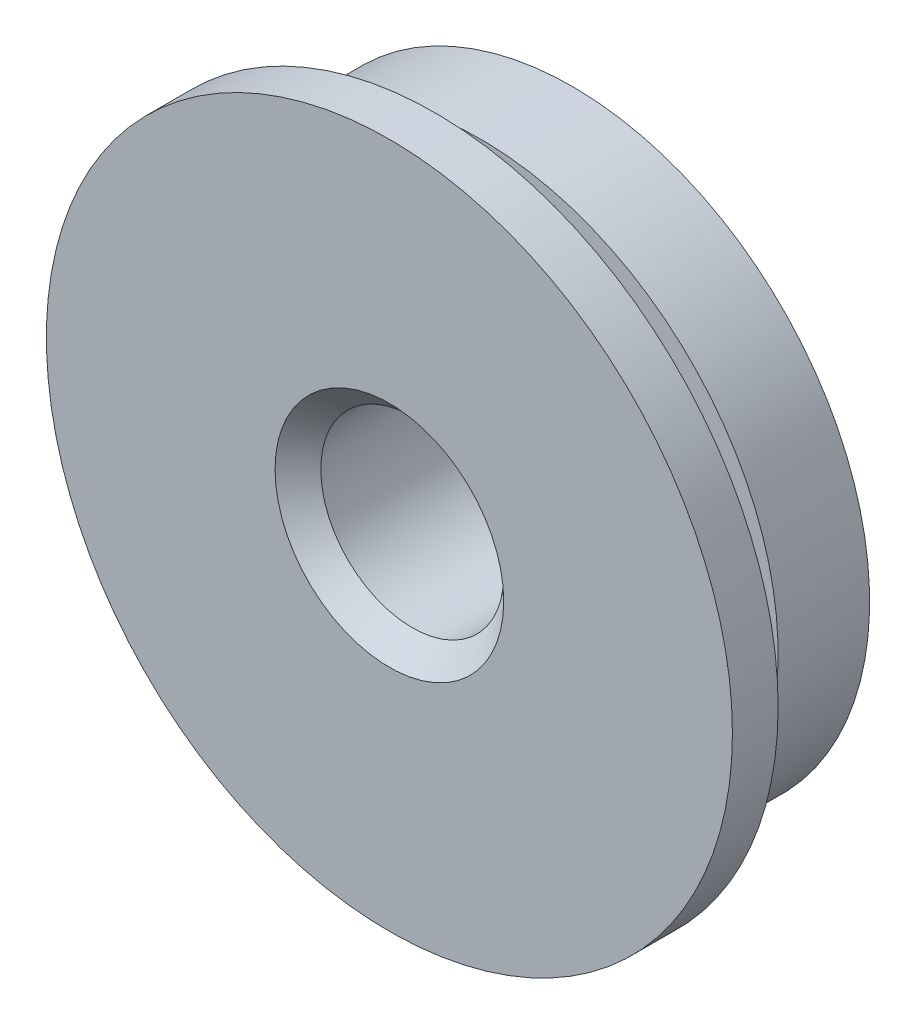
ISO-10303-21;
HEADER;
FILE_DESCRIPTION(('STEP AP214'),'2;1');
FILE_NAME('part.step','',(''),(''),'','','');
FILE_SCHEMA(('AUTOMOTIVE_DESIGN { 1 0 10303 214 1 1 1 1 }'));
ENDSEC;
DATA;
#1=APPLICATION_CONTEXT('core data for automotive mechanical design processes');
#2=APPLICATION_PROTOCOL_DEFINITION('international standard','automotive_design',2000,#1);
#3=PRODUCT_CONTEXT('',#1,'mechanical');
#4=PRODUCT('Part','Part','',(#3));
#5=PRODUCT_RELATED_PRODUCT_CATEGORY('part','',(#4));
#6=PRODUCT_DEFINITION_FORMATION('','',#4);
#7=PRODUCT_DEFINITION_CONTEXT('part definition',#1,'design');
#8=PRODUCT_DEFINITION('design','',#6,#7);
#9=PRODUCT_DEFINITION_SHAPE('','',#8);
#10=(LENGTH_UNIT() NAMED_UNIT(*) SI_UNIT(.MILLI.,.METRE.));
#11=(NAMED_UNIT(*) PLANE_ANGLE_UNIT() SI_UNIT($,.RADIAN.));
#12=(NAMED_UNIT(*) SI_UNIT($,.STERADIAN.) SOLID_ANGLE_UNIT());
#13=UNCERTAINTY_MEASURE_WITH_UNIT(LENGTH_MEASURE(1.E-05),#10,'distance_accuracy_value','');
#14=(GEOMETRIC_REPRESENTATION_CONTEXT(3) GLOBAL_UNCERTAINTY_ASSIGNED_CONTEXT((#13)) GLOBAL_UNIT_ASSIGNED_CONTEXT((#10,
#11,#12)) REPRESENTATION_CONTEXT('',''));
#15=CARTESIAN_POINT('',(0.,0.,0.));
#16=DIRECTION('',(0.,0.,1.));
#17=DIRECTION('',(1.,0.,0.));
#18=AXIS2_PLACEMENT_3D('',#15,#16,#17);
#19=CARTESIAN_POINT('',(0.,0.,-2.));
#20=DIRECTION('',(0.,0.,1.));
#21=DIRECTION('',(1.,0.,0.));
#22=AXIS2_PLACEMENT_3D('',#19,#20,#21);
#23=PLANE('',#22);
#24=CARTESIAN_POINT('',(0.,0.,-2.));
#25=DIRECTION('',(0.,0.,1.));
#26=DIRECTION('',(1.,0.,0.));
#27=AXIS2_PLACEMENT_3D('',#24,#25,#26);
#28=CIRCLE('',#27,15.);
#29=CARTESIAN_POINT('',(15.,0.,-2.));
#30=VERTEX_POINT('',#29);
#31=EDGE_CURVE('E55',#30,#30,#28,.T.);
#32=ORIENTED_EDGE('',*,*,#31,.F.);
#33=EDGE_LOOP('',(#32));
#34=FACE_BOUND('',#33,.T.);
#35=CARTESIAN_POINT('',(0.,0.,-2.));
#36=DIRECTION('',(0.,0.,1.));
#37=DIRECTION('',(1.,0.,0.));
#38=AXIS2_PLACEMENT_3D('',#35,#36,#37);
#39=CIRCLE('',#38,12.);
#40=CARTESIAN_POINT('',(12.,0.,-2.));
#41=VERTEX_POINT('',#40);
#42=EDGE_CURVE('E52',#41,#41,#39,.F.);
#43=ORIENTED_EDGE('',*,*,#42,.F.);
#44=EDGE_LOOP('',(#43));
#45=FACE_BOUND('',#44,.T.);
#46=ADVANCED_FACE('F32',(#34,#45),#23,.F.);
#47=CARTESIAN_POINT('',(0.,0.,-2.));
#48=DIRECTION('',(0.,0.,1.));
#49=DIRECTION('',(1.,0.,0.));
#50=AXIS2_PLACEMENT_3D('',#47,#48,#49);
#51=CYLINDRICAL_SURFACE('',#50,15.);
#52=ORIENTED_EDGE('',*,*,#31,.T.);
#53=EDGE_LOOP('',(#52));
#54=FACE_BOUND('',#53,.T.);
#55=CARTESIAN_POINT('',(0.,0.,0.));
#56=DIRECTION('',(0.,0.,1.));
#57=DIRECTION('',(1.,0.,0.));
#58=AXIS2_PLACEMENT_3D('',#55,#56,#57);
#59=CIRCLE('',#58,15.);
#60=CARTESIAN_POINT('',(15.,0.,0.));
#61=VERTEX_POINT('',#60);
#62=EDGE_CURVE('E56',#61,#61,#59,.T.);
#63=ORIENTED_EDGE('',*,*,#62,.F.);
#64=EDGE_LOOP('',(#63));
#65=FACE_BOUND('',#64,.T.);
#66=ADVANCED_FACE('F93',(#54,#65),#51,.T.);
#67=CARTESIAN_POINT('',(0.,0.,0.));
#68=DIRECTION('',(0.,0.,1.));
#69=DIRECTION('',(1.,0.,0.));
#70=AXIS2_PLACEMENT_3D('',#67,#68,#69);
#71=PLANE('',#70);
#72=CARTESIAN_POINT('',(0.,0.,0.));
#73=DIRECTION('',(0.,0.,1.));
#74=DIRECTION('',(1.,0.,0.));
#75=AXIS2_PLACEMENT_3D('',#72,#73,#74);
#76=CIRCLE('',#75,5.);
#77=CARTESIAN_POINT('',(5.,0.,0.));
#78=VERTEX_POINT('',#77);
#79=EDGE_CURVE('E10',#78,#78,#76,.F.);
#80=ORIENTED_EDGE('',*,*,#79,.T.);
#81=EDGE_LOOP('',(#80));
#82=FACE_BOUND('',#81,.T.);
#83=ORIENTED_EDGE('',*,*,#62,.T.);
#84=EDGE_LOOP('',(#83));
#85=FACE_BOUND('',#84,.T.);
#86=ADVANCED_FACE('F88',(#82,#85),#71,.T.);
#87=CARTESIAN_POINT('',(0.,0.,-4.));
#88=DIRECTION('',(0.,0.,1.));
#89=DIRECTION('',(1.,0.,0.));
#90=AXIS2_PLACEMENT_3D('',#87,#88,#89);
#91=CYLINDRICAL_SURFACE('',#90,12.);
#92=CARTESIAN_POINT('',(0.,0.,-4.));
#93=DIRECTION('',(0.,0.,-1.));
#94=DIRECTION('',(-1.,0.,0.));
#95=AXIS2_PLACEMENT_3D('',#92,#93,#94);
#96=CIRCLE('',#95,12.);
#97=CARTESIAN_POINT('',(-12.,0.,-4.));
#98=VERTEX_POINT('',#97);
#99=EDGE_CURVE('E59',#98,#98,#96,.T.);
#100=ORIENTED_EDGE('',*,*,#99,.F.);
#101=EDGE_LOOP('',(#100));
#102=FACE_BOUND('',#101,.T.);
#103=ORIENTED_EDGE('',*,*,#42,.T.);
#104=EDGE_LOOP('',(#103));
#105=FACE_BOUND('',#104,.T.);
#106=ADVANCED_FACE('F82',(#102,#105),#91,.T.);
#107=CARTESIAN_POINT('',(0.,0.,-4.));
#108=DIRECTION('',(0.,0.,-1.));
#109=DIRECTION('',(-1.,0.,0.));
#110=AXIS2_PLACEMENT_3D('',#107,#108,#109);
#111=PLANE('',#110);
#112=CARTESIAN_POINT('',(0.,0.,-4.));
#113=DIRECTION('',(0.,0.,-1.));
#114=DIRECTION('',(-1.,0.,0.));
#115=AXIS2_PLACEMENT_3D('',#112,#113,#114);
#116=CIRCLE('',#115,13.);
#117=CARTESIAN_POINT('',(-13.,0.,-4.));
#118=VERTEX_POINT('',#117);
#119=EDGE_CURVE('E65',#118,#118,#116,.T.);
#120=ORIENTED_EDGE('',*,*,#119,.F.);
#121=EDGE_LOOP('',(#120));
#122=FACE_BOUND('',#121,.T.);
#123=ORIENTED_EDGE('',*,*,#99,.T.);
#124=EDGE_LOOP('',(#123));
#125=FACE_BOUND('',#124,.T.);
#126=ADVANCED_FACE('F76',(#122,#125),#111,.F.);
#127=CARTESIAN_POINT('',(0.,0.,-8.));
#128=DIRECTION('',(0.,0.,1.));
#129=DIRECTION('',(1.,0.,0.));
#130=AXIS2_PLACEMENT_3D('',#127,#128,#129);
#131=CYLINDRICAL_SURFACE('',#130,13.);
#132=CARTESIAN_POINT('',(0.,0.,-8.));
#133=DIRECTION('',(0.,0.,-1.));
#134=DIRECTION('',(-1.,0.,0.));
#135=AXIS2_PLACEMENT_3D('',#132,#133,#134);
#136=CIRCLE('',#135,13.);
#137=CARTESIAN_POINT('',(-13.,0.,-8.));
#138=VERTEX_POINT('',#137);
#139=EDGE_CURVE('E64',#138,#138,#136,.T.);
#140=ORIENTED_EDGE('',*,*,#139,.F.);
#141=EDGE_LOOP('',(#140));
#142=FACE_BOUND('',#141,.T.);
#143=ORIENTED_EDGE('',*,*,#119,.T.);
#144=EDGE_LOOP('',(#143));
#145=FACE_BOUND('',#144,.T.);
#146=ADVANCED_FACE('F73',(#142,#145),#131,.T.);
#147=CARTESIAN_POINT('',(0.,0.,-8.));
#148=DIRECTION('',(0.,0.,-1.));
#149=DIRECTION('',(-1.,0.,0.));
#150=AXIS2_PLACEMENT_3D('',#147,#148,#149);
#151=PLANE('',#150);
#152=CARTESIAN_POINT('',(0.,0.,-8.));
#153=DIRECTION('',(0.,0.,-1.));
#154=DIRECTION('',(-1.,0.,0.));
#155=AXIS2_PLACEMENT_3D('',#152,#153,#154);
#156=CIRCLE('',#155,5.00000000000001);
#157=CARTESIAN_POINT('',(-5.00000000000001,0.,-8.));
#158=VERTEX_POINT('',#157);
#159=EDGE_CURVE('E39',#158,#158,#156,.F.);
#160=ORIENTED_EDGE('',*,*,#159,.T.);
#161=EDGE_LOOP('',(#160));
#162=FACE_BOUND('',#161,.T.);
#163=ORIENTED_EDGE('',*,*,#139,.T.);
#164=EDGE_LOOP('',(#163));
#165=FACE_BOUND('',#164,.T.);
#166=ADVANCED_FACE('F71',(#162,#165),#151,.T.);
#167=CARTESIAN_POINT('',(0.,0.,-10.));
#168=DIRECTION('',(0.,0.,1.));
#169=DIRECTION('',(1.,0.,0.));
#170=AXIS2_PLACEMENT_3D('',#167,#168,#169);
#171=CYLINDRICAL_SURFACE('',#170,4.);
#172=CARTESIAN_POINT('',(0.,0.,-7.));
#173=DIRECTION('',(0.,0.,-1.));
#174=DIRECTION('',(-1.,0.,0.));
#175=AXIS2_PLACEMENT_3D('',#172,#173,#174);
#176=CIRCLE('',#175,4.);
#177=CARTESIAN_POINT('',(-4.,0.,-7.));
#178=VERTEX_POINT('',#177);
#179=EDGE_CURVE('E43',#178,#178,#176,.T.);
#180=ORIENTED_EDGE('',*,*,#179,.T.);
#181=EDGE_LOOP('',(#180));
#182=FACE_BOUND('',#181,.T.);
#183=CARTESIAN_POINT('',(0.,0.,-0.999999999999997));
#184=DIRECTION('',(0.,0.,1.));
#185=DIRECTION('',(1.,0.,0.));
#186=AXIS2_PLACEMENT_3D('',#183,#184,#185);
#187=CIRCLE('',#186,4.);
#188=CARTESIAN_POINT('',(4.,0.,-0.999999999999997));
#189=VERTEX_POINT('',#188);
#190=EDGE_CURVE('E47',#189,#189,#187,.T.);
#191=ORIENTED_EDGE('',*,*,#190,.T.);
#192=EDGE_LOOP('',(#191));
#193=FACE_BOUND('',#192,.T.);
#194=ADVANCED_FACE('F106',(#182,#193),#171,.F.);
#195=CARTESIAN_POINT('',(0.,0.,-7.));
#196=DIRECTION('',(0.,0.,-1.));
#197=DIRECTION('',(-1.,0.,0.));
#198=AXIS2_PLACEMENT_3D('',#195,#196,#197);
#199=CONICAL_SURFACE('',#198,4.,0.785398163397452);
#200=ORIENTED_EDGE('',*,*,#159,.F.);
#201=EDGE_LOOP('',(#200));
#202=FACE_BOUND('',#201,.T.);
#203=ORIENTED_EDGE('',*,*,#179,.F.);
#204=EDGE_LOOP('',(#203));
#205=FACE_BOUND('',#204,.T.);
#206=ADVANCED_FACE('F104',(#202,#205),#199,.F.);
#207=CARTESIAN_POINT('',(0.,0.,-0.999999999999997));
#208=DIRECTION('',(0.,0.,1.));
#209=DIRECTION('',(1.,0.,0.));
#210=AXIS2_PLACEMENT_3D('',#207,#208,#209);
#211=CONICAL_SURFACE('',#210,4.,0.785398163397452);
#212=ORIENTED_EDGE('',*,*,#79,.F.);
#213=EDGE_LOOP('',(#212));
#214=FACE_BOUND('',#213,.T.);
#215=ORIENTED_EDGE('',*,*,#190,.F.);
#216=EDGE_LOOP('',(#215));
#217=FACE_BOUND('',#216,.T.);
#218=ADVANCED_FACE('F34',(#214,#217),#211,.F.);
#219=CLOSED_SHELL('',(#46,#66,#86,#106,#126,#146,#166,#194,#206,#218));
#220=MANIFOLD_SOLID_BREP('B2',#219);
#221=ADVANCED_BREP_SHAPE_REPRESENTATION('',(#18,#220),#14);
#222=SHAPE_DEFINITION_REPRESENTATION(#9,#221);
ENDSEC;
END-ISO-10303-21;
